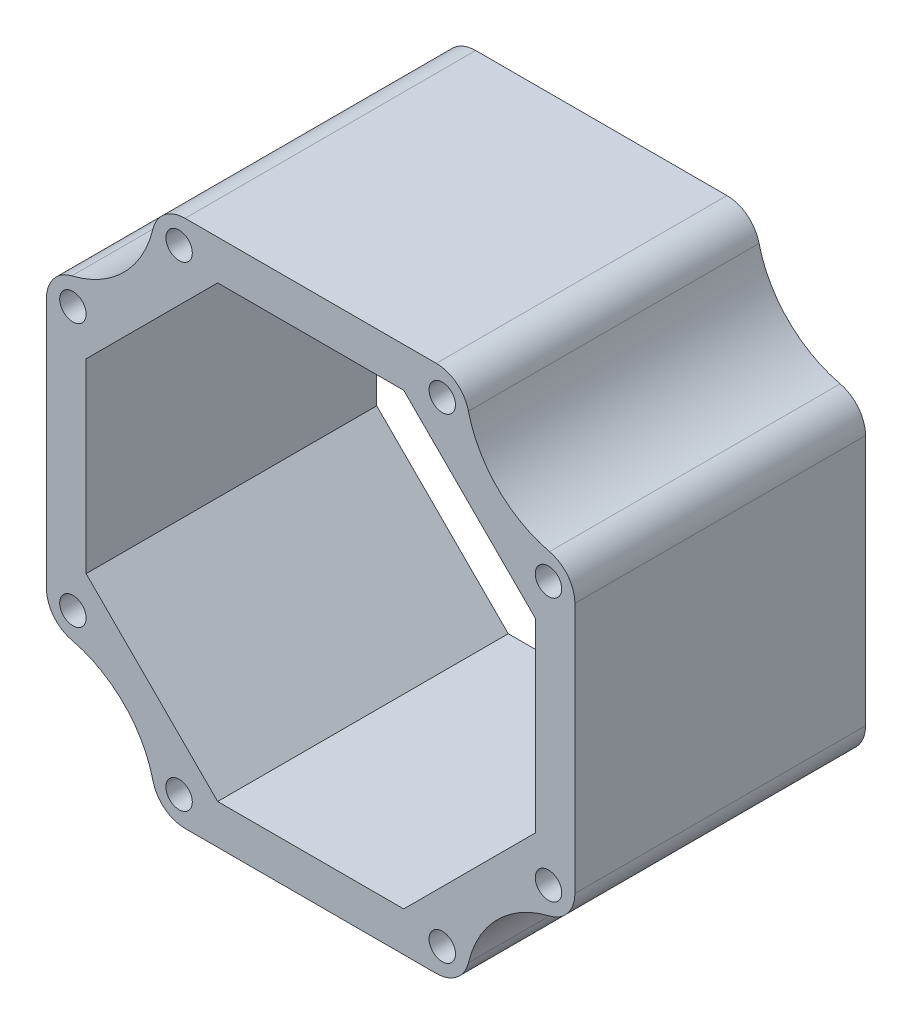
ISO-10303-21;
HEADER;
FILE_DESCRIPTION(('STEP AP214'),'2;1');
FILE_NAME('part.step','',(''),(''),'','','');
FILE_SCHEMA(('AUTOMOTIVE_DESIGN { 1 0 10303 214 1 1 1 1 }'));
ENDSEC;
DATA;
#1=APPLICATION_CONTEXT('core data for automotive mechanical design processes');
#2=APPLICATION_PROTOCOL_DEFINITION('international standard','automotive_design',2000,#1);
#3=PRODUCT_CONTEXT('',#1,'mechanical');
#4=PRODUCT('Part','Part','',(#3));
#5=PRODUCT_RELATED_PRODUCT_CATEGORY('part','',(#4));
#6=PRODUCT_DEFINITION_FORMATION('','',#4);
#7=PRODUCT_DEFINITION_CONTEXT('part definition',#1,'design');
#8=PRODUCT_DEFINITION('design','',#6,#7);
#9=PRODUCT_DEFINITION_SHAPE('','',#8);
#10=(LENGTH_UNIT() NAMED_UNIT(*) SI_UNIT(.MILLI.,.METRE.));
#11=(NAMED_UNIT(*) PLANE_ANGLE_UNIT() SI_UNIT($,.RADIAN.));
#12=(NAMED_UNIT(*) SI_UNIT($,.STERADIAN.) SOLID_ANGLE_UNIT());
#13=UNCERTAINTY_MEASURE_WITH_UNIT(LENGTH_MEASURE(1.E-05),#10,'distance_accuracy_value','');
#14=(GEOMETRIC_REPRESENTATION_CONTEXT(3) GLOBAL_UNCERTAINTY_ASSIGNED_CONTEXT((#13)) GLOBAL_UNIT_ASSIGNED_CONTEXT((#10,
#11,#12)) REPRESENTATION_CONTEXT('',''));
#15=CARTESIAN_POINT('',(0.,0.,0.));
#16=DIRECTION('',(0.,0.,1.));
#17=DIRECTION('',(1.,0.,0.));
#18=AXIS2_PLACEMENT_3D('',#15,#16,#17);
#19=CARTESIAN_POINT('',(20.,20.,-11.));
#20=DIRECTION('',(0.,0.,1.));
#21=DIRECTION('',(1.,0.,0.));
#22=AXIS2_PLACEMENT_3D('',#19,#20,#21);
#23=CYLINDRICAL_SURFACE('',#22,8.2842712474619);
#24=CARTESIAN_POINT('',(20.,20.,11.));
#25=DIRECTION('',(0.,0.,-1.));
#26=DIRECTION('',(-1.,0.,0.));
#27=AXIS2_PLACEMENT_3D('',#24,#25,#26);
#28=CIRCLE('',#27,8.2842712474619);
#29=CARTESIAN_POINT('',(18.0795477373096,11.9414012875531,11.));
#30=VERTEX_POINT('',#29);
#31=CARTESIAN_POINT('',(11.9414012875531,18.0795477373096,11.));
#32=VERTEX_POINT('',#31);
#33=EDGE_CURVE('E241',#30,#32,#28,.T.);
#34=ORIENTED_EDGE('',*,*,#33,.F.);
#35=DIRECTION('',(0.,0.,1.));
#36=VECTOR('',#35,1.);
#37=CARTESIAN_POINT('',(18.0795477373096,11.9414012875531,-11.));
#38=LINE('',#37,#36);
#39=CARTESIAN_POINT('',(18.0795477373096,11.9414012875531,-11.));
#40=VERTEX_POINT('',#39);
#41=EDGE_CURVE('E369',#30,#40,#38,.F.);
#42=ORIENTED_EDGE('',*,*,#41,.T.);
#43=CARTESIAN_POINT('',(20.,20.,-11.));
#44=DIRECTION('',(0.,0.,-1.));
#45=DIRECTION('',(-1.,0.,0.));
#46=AXIS2_PLACEMENT_3D('',#43,#44,#45);
#47=CIRCLE('',#46,8.2842712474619);
#48=CARTESIAN_POINT('',(11.9414012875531,18.0795477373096,-11.));
#49=VERTEX_POINT('',#48);
#50=EDGE_CURVE('E286',#40,#49,#47,.T.);
#51=ORIENTED_EDGE('',*,*,#50,.T.);
#52=DIRECTION('',(0.,0.,1.));
#53=VECTOR('',#52,1.);
#54=CARTESIAN_POINT('',(11.9414012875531,18.0795477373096,-11.));
#55=LINE('',#54,#53);
#56=EDGE_CURVE('E366',#49,#32,#55,.T.);
#57=ORIENTED_EDGE('',*,*,#56,.T.);
#58=EDGE_LOOP('',(#34,#42,#51,#57));
#59=FACE_BOUND('',#58,.T.);
#60=ADVANCED_FACE('F32',(#59),#23,.F.);
#61=CARTESIAN_POINT('',(20.,11.7157287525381,-11.));
#62=DIRECTION('',(1.,0.,0.));
#63=DIRECTION('',(0.,0.,-1.));
#64=AXIS2_PLACEMENT_3D('',#61,#62,#63);
#65=PLANE('',#64);
#66=DIRECTION('',(0.,1.,0.));
#67=VECTOR('',#66,1.);
#68=CARTESIAN_POINT('',(20.,11.7157287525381,11.));
#69=LINE('',#68,#67);
#70=CARTESIAN_POINT('',(20.,-9.50950399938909,11.));
#71=VERTEX_POINT('',#70);
#72=CARTESIAN_POINT('',(20.,9.50950399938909,11.));
#73=VERTEX_POINT('',#72);
#74=EDGE_CURVE('E262',#71,#73,#69,.T.);
#75=ORIENTED_EDGE('',*,*,#74,.F.);
#76=DIRECTION('',(0.,0.,1.));
#77=VECTOR('',#76,1.);
#78=CARTESIAN_POINT('',(20.,-9.50950399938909,-11.));
#79=LINE('',#78,#77);
#80=CARTESIAN_POINT('',(20.,-9.50950399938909,-11.));
#81=VERTEX_POINT('',#80);
#82=EDGE_CURVE('E364',#71,#81,#79,.F.);
#83=ORIENTED_EDGE('',*,*,#82,.T.);
#84=DIRECTION('',(0.,1.,0.));
#85=VECTOR('',#84,1.);
#86=CARTESIAN_POINT('',(20.,11.7157287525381,-11.));
#87=LINE('',#86,#85);
#88=CARTESIAN_POINT('',(20.,9.50950399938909,-11.));
#89=VERTEX_POINT('',#88);
#90=EDGE_CURVE('E317',#81,#89,#87,.T.);
#91=ORIENTED_EDGE('',*,*,#90,.T.);
#92=DIRECTION('',(0.,0.,1.));
#93=VECTOR('',#92,1.);
#94=CARTESIAN_POINT('',(20.,9.50950399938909,-11.));
#95=LINE('',#94,#93);
#96=EDGE_CURVE('E361',#89,#73,#95,.T.);
#97=ORIENTED_EDGE('',*,*,#96,.T.);
#98=EDGE_LOOP('',(#75,#83,#91,#97));
#99=FACE_BOUND('',#98,.T.);
#100=ADVANCED_FACE('F412',(#99),#65,.T.);
#101=CARTESIAN_POINT('',(20.,-20.,-11.));
#102=DIRECTION('',(0.,0.,1.));
#103=DIRECTION('',(1.,0.,0.));
#104=AXIS2_PLACEMENT_3D('',#101,#102,#103);
#105=CYLINDRICAL_SURFACE('',#104,8.2842712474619);
#106=CARTESIAN_POINT('',(20.,-20.,11.));
#107=DIRECTION('',(0.,0.,-1.));
#108=DIRECTION('',(-1.,0.,0.));
#109=AXIS2_PLACEMENT_3D('',#106,#107,#108);
#110=CIRCLE('',#109,8.2842712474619);
#111=CARTESIAN_POINT('',(11.9414012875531,-18.0795477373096,11.));
#112=VERTEX_POINT('',#111);
#113=CARTESIAN_POINT('',(18.0795477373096,-11.9414012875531,11.));
#114=VERTEX_POINT('',#113);
#115=EDGE_CURVE('E259',#112,#114,#110,.T.);
#116=ORIENTED_EDGE('',*,*,#115,.F.);
#117=DIRECTION('',(0.,0.,1.));
#118=VECTOR('',#117,1.);
#119=CARTESIAN_POINT('',(11.9414012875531,-18.0795477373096,-11.));
#120=LINE('',#119,#118);
#121=CARTESIAN_POINT('',(11.9414012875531,-18.0795477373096,-11.));
#122=VERTEX_POINT('',#121);
#123=EDGE_CURVE('E344',#112,#122,#120,.F.);
#124=ORIENTED_EDGE('',*,*,#123,.T.);
#125=CARTESIAN_POINT('',(20.,-20.,-11.));
#126=DIRECTION('',(0.,0.,-1.));
#127=DIRECTION('',(-1.,0.,0.));
#128=AXIS2_PLACEMENT_3D('',#125,#126,#127);
#129=CIRCLE('',#128,8.2842712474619);
#130=CARTESIAN_POINT('',(18.0795477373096,-11.9414012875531,-11.));
#131=VERTEX_POINT('',#130);
#132=EDGE_CURVE('E314',#122,#131,#129,.T.);
#133=ORIENTED_EDGE('',*,*,#132,.T.);
#134=DIRECTION('',(0.,0.,1.));
#135=VECTOR('',#134,1.);
#136=CARTESIAN_POINT('',(18.0795477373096,-11.9414012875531,-11.));
#137=LINE('',#136,#135);
#138=EDGE_CURVE('E341',#131,#114,#137,.T.);
#139=ORIENTED_EDGE('',*,*,#138,.T.);
#140=EDGE_LOOP('',(#116,#124,#133,#139));
#141=FACE_BOUND('',#140,.T.);
#142=ADVANCED_FACE('F420',(#141),#105,.F.);
#143=CARTESIAN_POINT('',(-11.7157287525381,-20.,-11.));
#144=DIRECTION('',(0.,-1.,0.));
#145=DIRECTION('',(0.,0.,-1.));
#146=AXIS2_PLACEMENT_3D('',#143,#144,#145);
#147=PLANE('',#146);
#148=DIRECTION('',(1.,0.,0.));
#149=VECTOR('',#148,1.);
#150=CARTESIAN_POINT('',(-11.7157287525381,-20.,-11.));
#151=LINE('',#150,#149);
#152=CARTESIAN_POINT('',(-9.50950399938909,-20.,-11.));
#153=VERTEX_POINT('',#152);
#154=CARTESIAN_POINT('',(9.50950399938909,-20.,-11.));
#155=VERTEX_POINT('',#154);
#156=EDGE_CURVE('E311',#153,#155,#151,.T.);
#157=ORIENTED_EDGE('',*,*,#156,.T.);
#158=DIRECTION('',(0.,0.,1.));
#159=VECTOR('',#158,1.);
#160=CARTESIAN_POINT('',(9.50950399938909,-20.,-11.));
#161=LINE('',#160,#159);
#162=CARTESIAN_POINT('',(9.50950399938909,-20.,11.));
#163=VERTEX_POINT('',#162);
#164=EDGE_CURVE('E322',#155,#163,#161,.T.);
#165=ORIENTED_EDGE('',*,*,#164,.T.);
#166=DIRECTION('',(1.,0.,0.));
#167=VECTOR('',#166,1.);
#168=CARTESIAN_POINT('',(-11.7157287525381,-20.,11.));
#169=LINE('',#168,#167);
#170=CARTESIAN_POINT('',(-9.50950399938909,-20.,11.));
#171=VERTEX_POINT('',#170);
#172=EDGE_CURVE('E256',#171,#163,#169,.T.);
#173=ORIENTED_EDGE('',*,*,#172,.F.);
#174=DIRECTION('',(0.,0.,1.));
#175=VECTOR('',#174,1.);
#176=CARTESIAN_POINT('',(-9.50950399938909,-20.,-11.));
#177=LINE('',#176,#175);
#178=EDGE_CURVE('E320',#171,#153,#177,.F.);
#179=ORIENTED_EDGE('',*,*,#178,.T.);
#180=EDGE_LOOP('',(#157,#165,#173,#179));
#181=FACE_BOUND('',#180,.T.);
#182=ADVANCED_FACE('F429',(#181),#147,.T.);
#183=CARTESIAN_POINT('',(-20.,-20.,-11.));
#184=DIRECTION('',(0.,0.,1.));
#185=DIRECTION('',(1.,0.,0.));
#186=AXIS2_PLACEMENT_3D('',#183,#184,#185);
#187=CYLINDRICAL_SURFACE('',#186,8.2842712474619);
#188=CARTESIAN_POINT('',(-20.,-20.,-11.));
#189=DIRECTION('',(0.,0.,-1.));
#190=DIRECTION('',(-1.,0.,0.));
#191=AXIS2_PLACEMENT_3D('',#188,#189,#190);
#192=CIRCLE('',#191,8.2842712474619);
#193=CARTESIAN_POINT('',(-18.0795477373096,-11.9414012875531,-11.));
#194=VERTEX_POINT('',#193);
#195=CARTESIAN_POINT('',(-11.9414012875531,-18.0795477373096,-11.));
#196=VERTEX_POINT('',#195);
#197=EDGE_CURVE('E308',#194,#196,#192,.T.);
#198=ORIENTED_EDGE('',*,*,#197,.T.);
#199=DIRECTION('',(0.,0.,1.));
#200=VECTOR('',#199,1.);
#201=CARTESIAN_POINT('',(-11.9414012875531,-18.0795477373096,-11.));
#202=LINE('',#201,#200);
#203=CARTESIAN_POINT('',(-11.9414012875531,-18.0795477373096,11.));
#204=VERTEX_POINT('',#203);
#205=EDGE_CURVE('E377',#196,#204,#202,.T.);
#206=ORIENTED_EDGE('',*,*,#205,.T.);
#207=CARTESIAN_POINT('',(-20.,-20.,11.));
#208=DIRECTION('',(0.,0.,-1.));
#209=DIRECTION('',(-1.,0.,0.));
#210=AXIS2_PLACEMENT_3D('',#207,#208,#209);
#211=CIRCLE('',#210,8.2842712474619);
#212=CARTESIAN_POINT('',(-18.0795477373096,-11.9414012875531,11.));
#213=VERTEX_POINT('',#212);
#214=EDGE_CURVE('E253',#213,#204,#211,.T.);
#215=ORIENTED_EDGE('',*,*,#214,.F.);
#216=DIRECTION('',(0.,0.,1.));
#217=VECTOR('',#216,1.);
#218=CARTESIAN_POINT('',(-18.0795477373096,-11.9414012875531,-11.));
#219=LINE('',#218,#217);
#220=EDGE_CURVE('E375',#213,#194,#219,.F.);
#221=ORIENTED_EDGE('',*,*,#220,.T.);
#222=EDGE_LOOP('',(#198,#206,#215,#221));
#223=FACE_BOUND('',#222,.T.);
#224=ADVANCED_FACE('F437',(#223),#187,.F.);
#225=CARTESIAN_POINT('',(-20.,11.7157287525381,-11.));
#226=DIRECTION('',(-1.,0.,0.));
#227=DIRECTION('',(0.,0.,1.));
#228=AXIS2_PLACEMENT_3D('',#225,#226,#227);
#229=PLANE('',#228);
#230=DIRECTION('',(0.,-1.,0.));
#231=VECTOR('',#230,1.);
#232=CARTESIAN_POINT('',(-20.,11.7157287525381,-11.));
#233=LINE('',#232,#231);
#234=CARTESIAN_POINT('',(-20.,9.50950399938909,-11.));
#235=VERTEX_POINT('',#234);
#236=CARTESIAN_POINT('',(-20.,-9.50950399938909,-11.));
#237=VERTEX_POINT('',#236);
#238=EDGE_CURVE('E305',#235,#237,#233,.T.);
#239=ORIENTED_EDGE('',*,*,#238,.T.);
#240=DIRECTION('',(0.,0.,1.));
#241=VECTOR('',#240,1.);
#242=CARTESIAN_POINT('',(-20.,-9.50950399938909,-11.));
#243=LINE('',#242,#241);
#244=CARTESIAN_POINT('',(-20.,-9.50950399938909,11.));
#245=VERTEX_POINT('',#244);
#246=EDGE_CURVE('E382',#237,#245,#243,.T.);
#247=ORIENTED_EDGE('',*,*,#246,.T.);
#248=DIRECTION('',(0.,-1.,0.));
#249=VECTOR('',#248,1.);
#250=CARTESIAN_POINT('',(-20.,11.7157287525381,11.));
#251=LINE('',#250,#249);
#252=CARTESIAN_POINT('',(-20.,9.50950399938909,11.));
#253=VERTEX_POINT('',#252);
#254=EDGE_CURVE('E250',#253,#245,#251,.T.);
#255=ORIENTED_EDGE('',*,*,#254,.F.);
#256=DIRECTION('',(0.,0.,1.));
#257=VECTOR('',#256,1.);
#258=CARTESIAN_POINT('',(-20.,9.50950399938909,-11.));
#259=LINE('',#258,#257);
#260=EDGE_CURVE('E380',#253,#235,#259,.F.);
#261=ORIENTED_EDGE('',*,*,#260,.T.);
#262=EDGE_LOOP('',(#239,#247,#255,#261));
#263=FACE_BOUND('',#262,.T.);
#264=ADVANCED_FACE('F446',(#263),#229,.T.);
#265=CARTESIAN_POINT('',(-20.,20.,-11.));
#266=DIRECTION('',(0.,0.,1.));
#267=DIRECTION('',(1.,0.,0.));
#268=AXIS2_PLACEMENT_3D('',#265,#266,#267);
#269=CYLINDRICAL_SURFACE('',#268,8.2842712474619);
#270=CARTESIAN_POINT('',(-20.,20.,-11.));
#271=DIRECTION('',(0.,0.,-1.));
#272=DIRECTION('',(-1.,0.,0.));
#273=AXIS2_PLACEMENT_3D('',#270,#271,#272);
#274=CIRCLE('',#273,8.2842712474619);
#275=CARTESIAN_POINT('',(-11.9414012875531,18.0795477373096,-11.));
#276=VERTEX_POINT('',#275);
#277=CARTESIAN_POINT('',(-18.0795477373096,11.9414012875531,-11.));
#278=VERTEX_POINT('',#277);
#279=EDGE_CURVE('E302',#276,#278,#274,.T.);
#280=ORIENTED_EDGE('',*,*,#279,.T.);
#281=DIRECTION('',(0.,0.,1.));
#282=VECTOR('',#281,1.);
#283=CARTESIAN_POINT('',(-18.0795477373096,11.9414012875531,-11.));
#284=LINE('',#283,#282);
#285=CARTESIAN_POINT('',(-18.0795477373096,11.9414012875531,11.));
#286=VERTEX_POINT('',#285);
#287=EDGE_CURVE('E11',#278,#286,#284,.T.);
#288=ORIENTED_EDGE('',*,*,#287,.T.);
#289=CARTESIAN_POINT('',(-20.,20.,11.));
#290=DIRECTION('',(0.,0.,-1.));
#291=DIRECTION('',(-1.,0.,0.));
#292=AXIS2_PLACEMENT_3D('',#289,#290,#291);
#293=CIRCLE('',#292,8.2842712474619);
#294=CARTESIAN_POINT('',(-11.9414012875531,18.0795477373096,11.));
#295=VERTEX_POINT('',#294);
#296=EDGE_CURVE('E247',#295,#286,#293,.T.);
#297=ORIENTED_EDGE('',*,*,#296,.F.);
#298=DIRECTION('',(0.,0.,1.));
#299=VECTOR('',#298,1.);
#300=CARTESIAN_POINT('',(-11.9414012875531,18.0795477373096,-11.));
#301=LINE('',#300,#299);
#302=EDGE_CURVE('E40',#295,#276,#301,.F.);
#303=ORIENTED_EDGE('',*,*,#302,.T.);
#304=EDGE_LOOP('',(#280,#288,#297,#303));
#305=FACE_BOUND('',#304,.T.);
#306=ADVANCED_FACE('F387',(#305),#269,.F.);
#307=CARTESIAN_POINT('',(-11.7157287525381,20.,-11.));
#308=DIRECTION('',(0.,1.,0.));
#309=DIRECTION('',(0.,0.,1.));
#310=AXIS2_PLACEMENT_3D('',#307,#308,#309);
#311=PLANE('',#310);
#312=DIRECTION('',(-1.,0.,0.));
#313=VECTOR('',#312,1.);
#314=CARTESIAN_POINT('',(-11.7157287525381,20.,11.));
#315=LINE('',#314,#313);
#316=CARTESIAN_POINT('',(9.50950399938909,20.,11.));
#317=VERTEX_POINT('',#316);
#318=CARTESIAN_POINT('',(-9.50950399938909,20.,11.));
#319=VERTEX_POINT('',#318);
#320=EDGE_CURVE('E244',#317,#319,#315,.T.);
#321=ORIENTED_EDGE('',*,*,#320,.F.);
#322=DIRECTION('',(0.,0.,1.));
#323=VECTOR('',#322,1.);
#324=CARTESIAN_POINT('',(9.50950399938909,20.,-11.));
#325=LINE('',#324,#323);
#326=CARTESIAN_POINT('',(9.50950399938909,20.,-11.));
#327=VERTEX_POINT('',#326);
#328=EDGE_CURVE('E54',#317,#327,#325,.F.);
#329=ORIENTED_EDGE('',*,*,#328,.T.);
#330=DIRECTION('',(-1.,0.,0.));
#331=VECTOR('',#330,1.);
#332=CARTESIAN_POINT('',(-11.7157287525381,20.,-11.));
#333=LINE('',#332,#331);
#334=CARTESIAN_POINT('',(-9.50950399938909,20.,-11.));
#335=VERTEX_POINT('',#334);
#336=EDGE_CURVE('E300',#327,#335,#333,.T.);
#337=ORIENTED_EDGE('',*,*,#336,.T.);
#338=DIRECTION('',(0.,0.,1.));
#339=VECTOR('',#338,1.);
#340=CARTESIAN_POINT('',(-9.50950399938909,20.,-11.));
#341=LINE('',#340,#339);
#342=EDGE_CURVE('E371',#335,#319,#341,.T.);
#343=ORIENTED_EDGE('',*,*,#342,.T.);
#344=EDGE_LOOP('',(#321,#329,#337,#343));
#345=FACE_BOUND('',#344,.T.);
#346=ADVANCED_FACE('F395',(#345),#311,.T.);
#347=CARTESIAN_POINT('',(20.,20.,-11.));
#348=DIRECTION('',(0.,0.,-1.));
#349=DIRECTION('',(-1.,0.,0.));
#350=AXIS2_PLACEMENT_3D('',#347,#348,#349);
#351=PLANE('',#350);
#352=CARTESIAN_POINT('',(-18.,-9.96077428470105,-11.));
#353=DIRECTION('',(0.,0.,-1.));
#354=DIRECTION('',(-1.,0.,0.));
#355=AXIS2_PLACEMENT_3D('',#352,#353,#354);
#356=CIRCLE('',#355,1.);
#357=CARTESIAN_POINT('',(-19.,-9.96077428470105,-11.));
#358=VERTEX_POINT('',#357);
#359=EDGE_CURVE('E765',#358,#358,#356,.F.);
#360=ORIENTED_EDGE('',*,*,#359,.T.);
#361=EDGE_LOOP('',(#360));
#362=FACE_BOUND('',#361,.T.);
#363=CARTESIAN_POINT('',(-9.96077428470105,-18.,-11.));
#364=DIRECTION('',(0.,0.,-1.));
#365=DIRECTION('',(-1.,0.,0.));
#366=AXIS2_PLACEMENT_3D('',#363,#364,#365);
#367=CIRCLE('',#366,1.);
#368=CARTESIAN_POINT('',(-10.9607742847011,-18.,-11.));
#369=VERTEX_POINT('',#368);
#370=EDGE_CURVE('E769',#369,#369,#367,.F.);
#371=ORIENTED_EDGE('',*,*,#370,.T.);
#372=EDGE_LOOP('',(#371));
#373=FACE_BOUND('',#372,.T.);
#374=CARTESIAN_POINT('',(9.96077428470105,-18.,-11.));
#375=DIRECTION('',(0.,0.,-1.));
#376=DIRECTION('',(-1.,0.,0.));
#377=AXIS2_PLACEMENT_3D('',#374,#375,#376);
#378=CIRCLE('',#377,1.);
#379=CARTESIAN_POINT('',(8.96077428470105,-18.,-11.));
#380=VERTEX_POINT('',#379);
#381=EDGE_CURVE('E778',#380,#380,#378,.F.);
#382=ORIENTED_EDGE('',*,*,#381,.T.);
#383=EDGE_LOOP('',(#382));
#384=FACE_BOUND('',#383,.T.);
#385=CARTESIAN_POINT('',(18.,-9.96077428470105,-11.));
#386=DIRECTION('',(0.,0.,-1.));
#387=DIRECTION('',(-1.,0.,0.));
#388=AXIS2_PLACEMENT_3D('',#385,#386,#387);
#389=CIRCLE('',#388,1.);
#390=CARTESIAN_POINT('',(17.,-9.96077428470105,-11.));
#391=VERTEX_POINT('',#390);
#392=EDGE_CURVE('E784',#391,#391,#389,.F.);
#393=ORIENTED_EDGE('',*,*,#392,.T.);
#394=EDGE_LOOP('',(#393));
#395=FACE_BOUND('',#394,.T.);
#396=CARTESIAN_POINT('',(18.,9.96077428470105,-11.));
#397=DIRECTION('',(0.,0.,-1.));
#398=DIRECTION('',(-1.,0.,0.));
#399=AXIS2_PLACEMENT_3D('',#396,#397,#398);
#400=CIRCLE('',#399,1.);
#401=CARTESIAN_POINT('',(17.,9.96077428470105,-11.));
#402=VERTEX_POINT('',#401);
#403=EDGE_CURVE('E790',#402,#402,#400,.F.);
#404=ORIENTED_EDGE('',*,*,#403,.T.);
#405=EDGE_LOOP('',(#404));
#406=FACE_BOUND('',#405,.T.);
#407=CARTESIAN_POINT('',(9.96077428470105,18.,-11.));
#408=DIRECTION('',(0.,0.,-1.));
#409=DIRECTION('',(-1.,0.,0.));
#410=AXIS2_PLACEMENT_3D('',#407,#408,#409);
#411=CIRCLE('',#410,1.);
#412=CARTESIAN_POINT('',(8.96077428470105,18.,-11.));
#413=VERTEX_POINT('',#412);
#414=EDGE_CURVE('E796',#413,#413,#411,.F.);
#415=ORIENTED_EDGE('',*,*,#414,.T.);
#416=EDGE_LOOP('',(#415));
#417=FACE_BOUND('',#416,.T.);
#418=CARTESIAN_POINT('',(-9.96077428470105,18.,-11.));
#419=DIRECTION('',(0.,0.,-1.));
#420=DIRECTION('',(-1.,0.,0.));
#421=AXIS2_PLACEMENT_3D('',#418,#419,#420);
#422=CIRCLE('',#421,1.);
#423=CARTESIAN_POINT('',(-10.9607742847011,18.,-11.));
#424=VERTEX_POINT('',#423);
#425=EDGE_CURVE('E802',#424,#424,#422,.F.);
#426=ORIENTED_EDGE('',*,*,#425,.T.);
#427=EDGE_LOOP('',(#426));
#428=FACE_BOUND('',#427,.T.);
#429=CARTESIAN_POINT('',(-18.,9.96077428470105,-11.));
#430=DIRECTION('',(0.,0.,-1.));
#431=DIRECTION('',(-1.,0.,0.));
#432=AXIS2_PLACEMENT_3D('',#429,#430,#431);
#433=CIRCLE('',#432,1.);
#434=CARTESIAN_POINT('',(-19.,9.96077428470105,-11.));
#435=VERTEX_POINT('',#434);
#436=EDGE_CURVE('E217',#435,#435,#433,.F.);
#437=ORIENTED_EDGE('',*,*,#436,.T.);
#438=EDGE_LOOP('',(#437));
#439=FACE_BOUND('',#438,.T.);
#440=DIRECTION('',(-0.707106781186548,-0.707106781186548,0.));
#441=VECTOR('',#440,1.);
#442=CARTESIAN_POINT('',(-17.,7.04163056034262,-11.));
#443=LINE('',#442,#441);
#444=CARTESIAN_POINT('',(-7.04163056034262,17.,-11.));
#445=VERTEX_POINT('',#444);
#446=CARTESIAN_POINT('',(-17.,7.04163056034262,-11.));
#447=VERTEX_POINT('',#446);
#448=EDGE_CURVE('E265',#445,#447,#443,.T.);
#449=ORIENTED_EDGE('',*,*,#448,.T.);
#450=DIRECTION('',(0.,-1.,0.));
#451=VECTOR('',#450,1.);
#452=CARTESIAN_POINT('',(-17.,-7.04163056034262,-11.));
#453=LINE('',#452,#451);
#454=CARTESIAN_POINT('',(-17.,-7.04163056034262,-11.));
#455=VERTEX_POINT('',#454);
#456=EDGE_CURVE('E203',#447,#455,#453,.T.);
#457=ORIENTED_EDGE('',*,*,#456,.T.);
#458=DIRECTION('',(0.707106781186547,-0.707106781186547,0.));
#459=VECTOR('',#458,1.);
#460=CARTESIAN_POINT('',(-7.04163056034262,-17.,-11.));
#461=LINE('',#460,#459);
#462=CARTESIAN_POINT('',(-7.04163056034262,-17.,-11.));
#463=VERTEX_POINT('',#462);
#464=EDGE_CURVE('E268',#455,#463,#461,.T.);
#465=ORIENTED_EDGE('',*,*,#464,.T.);
#466=DIRECTION('',(1.,0.,0.));
#467=VECTOR('',#466,1.);
#468=CARTESIAN_POINT('',(7.04163056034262,-17.,-11.));
#469=LINE('',#468,#467);
#470=CARTESIAN_POINT('',(7.04163056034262,-17.,-11.));
#471=VERTEX_POINT('',#470);
#472=EDGE_CURVE('E271',#463,#471,#469,.T.);
#473=ORIENTED_EDGE('',*,*,#472,.T.);
#474=DIRECTION('',(0.707106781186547,0.707106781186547,0.));
#475=VECTOR('',#474,1.);
#476=CARTESIAN_POINT('',(17.,-7.04163056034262,-11.));
#477=LINE('',#476,#475);
#478=CARTESIAN_POINT('',(17.,-7.04163056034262,-11.));
#479=VERTEX_POINT('',#478);
#480=EDGE_CURVE('E274',#471,#479,#477,.T.);
#481=ORIENTED_EDGE('',*,*,#480,.T.);
#482=DIRECTION('',(0.,1.,0.));
#483=VECTOR('',#482,1.);
#484=CARTESIAN_POINT('',(17.,-7.04163056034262,-11.));
#485=LINE('',#484,#483);
#486=CARTESIAN_POINT('',(17.,7.04163056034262,-11.));
#487=VERTEX_POINT('',#486);
#488=EDGE_CURVE('E277',#479,#487,#485,.T.);
#489=ORIENTED_EDGE('',*,*,#488,.T.);
#490=DIRECTION('',(-0.707106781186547,0.707106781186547,0.));
#491=VECTOR('',#490,1.);
#492=CARTESIAN_POINT('',(7.04163056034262,17.,-11.));
#493=LINE('',#492,#491);
#494=CARTESIAN_POINT('',(7.04163056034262,17.,-11.));
#495=VERTEX_POINT('',#494);
#496=EDGE_CURVE('E280',#487,#495,#493,.T.);
#497=ORIENTED_EDGE('',*,*,#496,.T.);
#498=DIRECTION('',(-1.,0.,0.));
#499=VECTOR('',#498,1.);
#500=CARTESIAN_POINT('',(-7.04163056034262,17.,-11.));
#501=LINE('',#500,#499);
#502=EDGE_CURVE('E208',#495,#445,#501,.T.);
#503=ORIENTED_EDGE('',*,*,#502,.T.);
#504=EDGE_LOOP('',(#449,#457,#465,#473,#481,#489,#497,#503));
#505=FACE_BOUND('',#504,.T.);
#506=ORIENTED_EDGE('',*,*,#132,.F.);
#507=CARTESIAN_POINT('',(9.50950399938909,-17.5,-11.));
#508=DIRECTION('',(0.,0.,-1.));
#509=DIRECTION('',(-1.,0.,0.));
#510=AXIS2_PLACEMENT_3D('',#507,#508,#509);
#511=CIRCLE('',#510,2.5);
#512=EDGE_CURVE('E359',#122,#155,#511,.T.);
#513=ORIENTED_EDGE('',*,*,#512,.T.);
#514=ORIENTED_EDGE('',*,*,#156,.F.);
#515=CARTESIAN_POINT('',(-9.50950399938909,-17.5,-11.));
#516=DIRECTION('',(0.,0.,-1.));
#517=DIRECTION('',(-1.,0.,0.));
#518=AXIS2_PLACEMENT_3D('',#515,#516,#517);
#519=CIRCLE('',#518,2.5);
#520=EDGE_CURVE('E351',#153,#196,#519,.T.);
#521=ORIENTED_EDGE('',*,*,#520,.T.);
#522=ORIENTED_EDGE('',*,*,#197,.F.);
#523=CARTESIAN_POINT('',(-17.5,-9.50950399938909,-11.));
#524=DIRECTION('',(0.,0.,-1.));
#525=DIRECTION('',(-1.,0.,0.));
#526=AXIS2_PLACEMENT_3D('',#523,#524,#525);
#527=CIRCLE('',#526,2.5);
#528=EDGE_CURVE('E349',#194,#237,#527,.T.);
#529=ORIENTED_EDGE('',*,*,#528,.T.);
#530=ORIENTED_EDGE('',*,*,#238,.F.);
#531=CARTESIAN_POINT('',(-17.5,9.50950399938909,-11.));
#532=DIRECTION('',(0.,0.,-1.));
#533=DIRECTION('',(-1.,0.,0.));
#534=AXIS2_PLACEMENT_3D('',#531,#532,#533);
#535=CIRCLE('',#534,2.5);
#536=EDGE_CURVE('E347',#235,#278,#535,.T.);
#537=ORIENTED_EDGE('',*,*,#536,.T.);
#538=ORIENTED_EDGE('',*,*,#279,.F.);
#539=CARTESIAN_POINT('',(-9.50950399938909,17.5,-11.));
#540=DIRECTION('',(0.,0.,-1.));
#541=DIRECTION('',(-1.,0.,0.));
#542=AXIS2_PLACEMENT_3D('',#539,#540,#541);
#543=CIRCLE('',#542,2.5);
#544=EDGE_CURVE('E47',#276,#335,#543,.T.);
#545=ORIENTED_EDGE('',*,*,#544,.T.);
#546=ORIENTED_EDGE('',*,*,#336,.F.);
#547=CARTESIAN_POINT('',(9.50950399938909,17.5,-11.));
#548=DIRECTION('',(0.,0.,-1.));
#549=DIRECTION('',(-1.,0.,0.));
#550=AXIS2_PLACEMENT_3D('',#547,#548,#549);
#551=CIRCLE('',#550,2.5);
#552=EDGE_CURVE('E353',#327,#49,#551,.T.);
#553=ORIENTED_EDGE('',*,*,#552,.T.);
#554=ORIENTED_EDGE('',*,*,#50,.F.);
#555=CARTESIAN_POINT('',(17.5,9.50950399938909,-11.));
#556=DIRECTION('',(0.,0.,-1.));
#557=DIRECTION('',(-1.,0.,0.));
#558=AXIS2_PLACEMENT_3D('',#555,#556,#557);
#559=CIRCLE('',#558,2.5);
#560=EDGE_CURVE('E355',#40,#89,#559,.T.);
#561=ORIENTED_EDGE('',*,*,#560,.T.);
#562=ORIENTED_EDGE('',*,*,#90,.F.);
#563=CARTESIAN_POINT('',(17.5,-9.50950399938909,-11.));
#564=DIRECTION('',(0.,0.,-1.));
#565=DIRECTION('',(-1.,0.,0.));
#566=AXIS2_PLACEMENT_3D('',#563,#564,#565);
#567=CIRCLE('',#566,2.5);
#568=EDGE_CURVE('E357',#81,#131,#567,.T.);
#569=ORIENTED_EDGE('',*,*,#568,.T.);
#570=EDGE_LOOP('',(#506,#513,#514,#521,#522,#529,#530,#537,#538,#545,#546,#553,#554,#561,#562,#569));
#571=FACE_BOUND('',#570,.T.);
#572=ADVANCED_FACE('F391',(#362,#373,#384,#395,#406,#417,#428,#439,#505,#571),#351,.T.);
#573=CARTESIAN_POINT('',(-17.,7.04163056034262,-11.));
#574=DIRECTION('',(-0.707106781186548,0.707106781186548,0.));
#575=DIRECTION('',(-0.707106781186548,-0.707106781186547,0.));
#576=AXIS2_PLACEMENT_3D('',#573,#574,#575);
#577=PLANE('',#576);
#578=DIRECTION('',(0.,0.,1.));
#579=VECTOR('',#578,1.);
#580=CARTESIAN_POINT('',(-7.04163056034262,17.,-11.));
#581=LINE('',#580,#579);
#582=CARTESIAN_POINT('',(-7.04163056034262,17.,11.));
#583=VERTEX_POINT('',#582);
#584=EDGE_CURVE('E213',#445,#583,#581,.T.);
#585=ORIENTED_EDGE('',*,*,#584,.T.);
#586=DIRECTION('',(-0.707106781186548,-0.707106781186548,0.));
#587=VECTOR('',#586,1.);
#588=CARTESIAN_POINT('',(-17.,7.04163056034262,11.));
#589=LINE('',#588,#587);
#590=CARTESIAN_POINT('',(-17.,7.04163056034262,11.));
#591=VERTEX_POINT('',#590);
#592=EDGE_CURVE('E211',#583,#591,#589,.T.);
#593=ORIENTED_EDGE('',*,*,#592,.T.);
#594=DIRECTION('',(0.,0.,1.));
#595=VECTOR('',#594,1.);
#596=CARTESIAN_POINT('',(-17.,7.04163056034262,-11.));
#597=LINE('',#596,#595);
#598=EDGE_CURVE('E195',#447,#591,#597,.T.);
#599=ORIENTED_EDGE('',*,*,#598,.F.);
#600=ORIENTED_EDGE('',*,*,#448,.F.);
#601=EDGE_LOOP('',(#585,#593,#599,#600));
#602=FACE_BOUND('',#601,.T.);
#603=ADVANCED_FACE('F212',(#602),#577,.F.);
#604=CARTESIAN_POINT('',(-7.04163056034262,17.,-11.));
#605=DIRECTION('',(0.,1.,0.));
#606=DIRECTION('',(0.,0.,1.));
#607=AXIS2_PLACEMENT_3D('',#604,#605,#606);
#608=PLANE('',#607);
#609=DIRECTION('',(0.,0.,1.));
#610=VECTOR('',#609,1.);
#611=CARTESIAN_POINT('',(7.04163056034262,17.,-11.));
#612=LINE('',#611,#610);
#613=CARTESIAN_POINT('',(7.04163056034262,17.,11.));
#614=VERTEX_POINT('',#613);
#615=EDGE_CURVE('E287',#495,#614,#612,.T.);
#616=ORIENTED_EDGE('',*,*,#615,.T.);
#617=DIRECTION('',(-1.,0.,0.));
#618=VECTOR('',#617,1.);
#619=CARTESIAN_POINT('',(-7.04163056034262,17.,11.));
#620=LINE('',#619,#618);
#621=EDGE_CURVE('E239',#614,#583,#620,.T.);
#622=ORIENTED_EDGE('',*,*,#621,.T.);
#623=ORIENTED_EDGE('',*,*,#584,.F.);
#624=ORIENTED_EDGE('',*,*,#502,.F.);
#625=EDGE_LOOP('',(#616,#622,#623,#624));
#626=FACE_BOUND('',#625,.T.);
#627=ADVANCED_FACE('F604',(#626),#608,.F.);
#628=CARTESIAN_POINT('',(7.04163056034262,17.,-11.));
#629=DIRECTION('',(0.707106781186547,0.707106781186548,0.));
#630=DIRECTION('',(-0.707106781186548,0.707106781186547,0.));
#631=AXIS2_PLACEMENT_3D('',#628,#629,#630);
#632=PLANE('',#631);
#633=DIRECTION('',(0.,0.,1.));
#634=VECTOR('',#633,1.);
#635=CARTESIAN_POINT('',(17.,7.04163056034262,-11.));
#636=LINE('',#635,#634);
#637=CARTESIAN_POINT('',(17.,7.04163056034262,11.));
#638=VERTEX_POINT('',#637);
#639=EDGE_CURVE('E289',#487,#638,#636,.T.);
#640=ORIENTED_EDGE('',*,*,#639,.T.);
#641=DIRECTION('',(-0.707106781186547,0.707106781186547,0.));
#642=VECTOR('',#641,1.);
#643=CARTESIAN_POINT('',(7.04163056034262,17.,11.));
#644=LINE('',#643,#642);
#645=EDGE_CURVE('E236',#638,#614,#644,.T.);
#646=ORIENTED_EDGE('',*,*,#645,.T.);
#647=ORIENTED_EDGE('',*,*,#615,.F.);
#648=ORIENTED_EDGE('',*,*,#496,.F.);
#649=EDGE_LOOP('',(#640,#646,#647,#648));
#650=FACE_BOUND('',#649,.T.);
#651=ADVANCED_FACE('F607',(#650),#632,.F.);
#652=CARTESIAN_POINT('',(17.,-7.04163056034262,-11.));
#653=DIRECTION('',(1.,0.,0.));
#654=DIRECTION('',(0.,0.,-1.));
#655=AXIS2_PLACEMENT_3D('',#652,#653,#654);
#656=PLANE('',#655);
#657=DIRECTION('',(0.,0.,1.));
#658=VECTOR('',#657,1.);
#659=CARTESIAN_POINT('',(17.,-7.04163056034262,-11.));
#660=LINE('',#659,#658);
#661=CARTESIAN_POINT('',(17.,-7.04163056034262,11.));
#662=VERTEX_POINT('',#661);
#663=EDGE_CURVE('E291',#479,#662,#660,.T.);
#664=ORIENTED_EDGE('',*,*,#663,.T.);
#665=DIRECTION('',(0.,1.,0.));
#666=VECTOR('',#665,1.);
#667=CARTESIAN_POINT('',(17.,-7.04163056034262,11.));
#668=LINE('',#667,#666);
#669=EDGE_CURVE('E233',#662,#638,#668,.T.);
#670=ORIENTED_EDGE('',*,*,#669,.T.);
#671=ORIENTED_EDGE('',*,*,#639,.F.);
#672=ORIENTED_EDGE('',*,*,#488,.F.);
#673=EDGE_LOOP('',(#664,#670,#671,#672));
#674=FACE_BOUND('',#673,.T.);
#675=ADVANCED_FACE('F611',(#674),#656,.F.);
#676=CARTESIAN_POINT('',(17.,-7.04163056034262,-11.));
#677=DIRECTION('',(0.707106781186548,-0.707106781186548,0.));
#678=DIRECTION('',(0.707106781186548,0.707106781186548,0.));
#679=AXIS2_PLACEMENT_3D('',#676,#677,#678);
#680=PLANE('',#679);
#681=DIRECTION('',(0.,0.,1.));
#682=VECTOR('',#681,1.);
#683=CARTESIAN_POINT('',(7.04163056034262,-17.,-11.));
#684=LINE('',#683,#682);
#685=CARTESIAN_POINT('',(7.04163056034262,-17.,11.));
#686=VERTEX_POINT('',#685);
#687=EDGE_CURVE('E293',#471,#686,#684,.T.);
#688=ORIENTED_EDGE('',*,*,#687,.T.);
#689=DIRECTION('',(0.707106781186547,0.707106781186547,0.));
#690=VECTOR('',#689,1.);
#691=CARTESIAN_POINT('',(17.,-7.04163056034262,11.));
#692=LINE('',#691,#690);
#693=EDGE_CURVE('E230',#686,#662,#692,.T.);
#694=ORIENTED_EDGE('',*,*,#693,.T.);
#695=ORIENTED_EDGE('',*,*,#663,.F.);
#696=ORIENTED_EDGE('',*,*,#480,.F.);
#697=EDGE_LOOP('',(#688,#694,#695,#696));
#698=FACE_BOUND('',#697,.T.);
#699=ADVANCED_FACE('F615',(#698),#680,.F.);
#700=CARTESIAN_POINT('',(7.04163056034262,-17.,-11.));
#701=DIRECTION('',(0.,-1.,0.));
#702=DIRECTION('',(0.,0.,-1.));
#703=AXIS2_PLACEMENT_3D('',#700,#701,#702);
#704=PLANE('',#703);
#705=DIRECTION('',(0.,0.,1.));
#706=VECTOR('',#705,1.);
#707=CARTESIAN_POINT('',(-7.04163056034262,-17.,-11.));
#708=LINE('',#707,#706);
#709=CARTESIAN_POINT('',(-7.04163056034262,-17.,11.));
#710=VERTEX_POINT('',#709);
#711=EDGE_CURVE('E295',#463,#710,#708,.T.);
#712=ORIENTED_EDGE('',*,*,#711,.T.);
#713=DIRECTION('',(1.,0.,0.));
#714=VECTOR('',#713,1.);
#715=CARTESIAN_POINT('',(7.04163056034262,-17.,11.));
#716=LINE('',#715,#714);
#717=EDGE_CURVE('E224',#710,#686,#716,.T.);
#718=ORIENTED_EDGE('',*,*,#717,.T.);
#719=ORIENTED_EDGE('',*,*,#687,.F.);
#720=ORIENTED_EDGE('',*,*,#472,.F.);
#721=EDGE_LOOP('',(#712,#718,#719,#720));
#722=FACE_BOUND('',#721,.T.);
#723=ADVANCED_FACE('F619',(#722),#704,.F.);
#724=CARTESIAN_POINT('',(-7.04163056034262,-17.,-11.));
#725=DIRECTION('',(-0.707106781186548,-0.707106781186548,0.));
#726=DIRECTION('',(0.707106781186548,-0.707106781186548,0.));
#727=AXIS2_PLACEMENT_3D('',#724,#725,#726);
#728=PLANE('',#727);
#729=DIRECTION('',(0.,0.,1.));
#730=VECTOR('',#729,1.);
#731=CARTESIAN_POINT('',(-17.,-7.04163056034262,-11.));
#732=LINE('',#731,#730);
#733=CARTESIAN_POINT('',(-17.,-7.04163056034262,11.));
#734=VERTEX_POINT('',#733);
#735=EDGE_CURVE('E207',#455,#734,#732,.T.);
#736=ORIENTED_EDGE('',*,*,#735,.T.);
#737=DIRECTION('',(0.707106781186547,-0.707106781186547,0.));
#738=VECTOR('',#737,1.);
#739=CARTESIAN_POINT('',(-7.04163056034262,-17.,11.));
#740=LINE('',#739,#738);
#741=EDGE_CURVE('E222',#734,#710,#740,.T.);
#742=ORIENTED_EDGE('',*,*,#741,.T.);
#743=ORIENTED_EDGE('',*,*,#711,.F.);
#744=ORIENTED_EDGE('',*,*,#464,.F.);
#745=EDGE_LOOP('',(#736,#742,#743,#744));
#746=FACE_BOUND('',#745,.T.);
#747=ADVANCED_FACE('F623',(#746),#728,.F.);
#748=CARTESIAN_POINT('',(-17.,-7.04163056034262,-11.));
#749=DIRECTION('',(-1.,0.,0.));
#750=DIRECTION('',(0.,0.,1.));
#751=AXIS2_PLACEMENT_3D('',#748,#749,#750);
#752=PLANE('',#751);
#753=ORIENTED_EDGE('',*,*,#598,.T.);
#754=DIRECTION('',(0.,-1.,0.));
#755=VECTOR('',#754,1.);
#756=CARTESIAN_POINT('',(-17.,-7.04163056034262,11.));
#757=LINE('',#756,#755);
#758=EDGE_CURVE('E200',#591,#734,#757,.T.);
#759=ORIENTED_EDGE('',*,*,#758,.T.);
#760=ORIENTED_EDGE('',*,*,#735,.F.);
#761=ORIENTED_EDGE('',*,*,#456,.F.);
#762=EDGE_LOOP('',(#753,#759,#760,#761));
#763=FACE_BOUND('',#762,.T.);
#764=ADVANCED_FACE('F197',(#763),#752,.F.);
#765=CARTESIAN_POINT('',(20.,20.,11.));
#766=DIRECTION('',(0.,0.,-1.));
#767=DIRECTION('',(-1.,0.,0.));
#768=AXIS2_PLACEMENT_3D('',#765,#766,#767);
#769=PLANE('',#768);
#770=CARTESIAN_POINT('',(-18.,-9.96077428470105,11.));
#771=DIRECTION('',(0.,0.,1.));
#772=DIRECTION('',(1.,0.,0.));
#773=AXIS2_PLACEMENT_3D('',#770,#771,#772);
#774=CIRCLE('',#773,1.);
#775=CARTESIAN_POINT('',(-17.,-9.96077428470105,11.));
#776=VERTEX_POINT('',#775);
#777=EDGE_CURVE('E762',#776,#776,#774,.T.);
#778=ORIENTED_EDGE('',*,*,#777,.F.);
#779=EDGE_LOOP('',(#778));
#780=FACE_BOUND('',#779,.T.);
#781=CARTESIAN_POINT('',(-9.96077428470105,-18.,11.));
#782=DIRECTION('',(0.,0.,1.));
#783=DIRECTION('',(1.,0.,0.));
#784=AXIS2_PLACEMENT_3D('',#781,#782,#783);
#785=CIRCLE('',#784,1.);
#786=CARTESIAN_POINT('',(-8.96077428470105,-18.,11.));
#787=VERTEX_POINT('',#786);
#788=EDGE_CURVE('E766',#787,#787,#785,.T.);
#789=ORIENTED_EDGE('',*,*,#788,.F.);
#790=EDGE_LOOP('',(#789));
#791=FACE_BOUND('',#790,.T.);
#792=CARTESIAN_POINT('',(9.96077428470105,-18.,11.));
#793=DIRECTION('',(0.,0.,1.));
#794=DIRECTION('',(1.,0.,0.));
#795=AXIS2_PLACEMENT_3D('',#792,#793,#794);
#796=CIRCLE('',#795,1.);
#797=CARTESIAN_POINT('',(10.9607742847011,-18.,11.));
#798=VERTEX_POINT('',#797);
#799=EDGE_CURVE('E775',#798,#798,#796,.T.);
#800=ORIENTED_EDGE('',*,*,#799,.F.);
#801=EDGE_LOOP('',(#800));
#802=FACE_BOUND('',#801,.T.);
#803=CARTESIAN_POINT('',(18.,-9.96077428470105,11.));
#804=DIRECTION('',(0.,0.,1.));
#805=DIRECTION('',(1.,0.,0.));
#806=AXIS2_PLACEMENT_3D('',#803,#804,#805);
#807=CIRCLE('',#806,1.);
#808=CARTESIAN_POINT('',(19.,-9.96077428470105,11.));
#809=VERTEX_POINT('',#808);
#810=EDGE_CURVE('E781',#809,#809,#807,.T.);
#811=ORIENTED_EDGE('',*,*,#810,.F.);
#812=EDGE_LOOP('',(#811));
#813=FACE_BOUND('',#812,.T.);
#814=CARTESIAN_POINT('',(18.,9.96077428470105,11.));
#815=DIRECTION('',(0.,0.,1.));
#816=DIRECTION('',(1.,0.,0.));
#817=AXIS2_PLACEMENT_3D('',#814,#815,#816);
#818=CIRCLE('',#817,1.);
#819=CARTESIAN_POINT('',(19.,9.96077428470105,11.));
#820=VERTEX_POINT('',#819);
#821=EDGE_CURVE('E787',#820,#820,#818,.T.);
#822=ORIENTED_EDGE('',*,*,#821,.F.);
#823=EDGE_LOOP('',(#822));
#824=FACE_BOUND('',#823,.T.);
#825=CARTESIAN_POINT('',(9.96077428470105,18.,11.));
#826=DIRECTION('',(0.,0.,1.));
#827=DIRECTION('',(1.,0.,0.));
#828=AXIS2_PLACEMENT_3D('',#825,#826,#827);
#829=CIRCLE('',#828,1.);
#830=CARTESIAN_POINT('',(10.9607742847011,18.,11.));
#831=VERTEX_POINT('',#830);
#832=EDGE_CURVE('E793',#831,#831,#829,.T.);
#833=ORIENTED_EDGE('',*,*,#832,.F.);
#834=EDGE_LOOP('',(#833));
#835=FACE_BOUND('',#834,.T.);
#836=CARTESIAN_POINT('',(-9.96077428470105,18.,11.));
#837=DIRECTION('',(0.,0.,1.));
#838=DIRECTION('',(1.,0.,0.));
#839=AXIS2_PLACEMENT_3D('',#836,#837,#838);
#840=CIRCLE('',#839,1.);
#841=CARTESIAN_POINT('',(-8.96077428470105,18.,11.));
#842=VERTEX_POINT('',#841);
#843=EDGE_CURVE('E799',#842,#842,#840,.T.);
#844=ORIENTED_EDGE('',*,*,#843,.F.);
#845=EDGE_LOOP('',(#844));
#846=FACE_BOUND('',#845,.T.);
#847=CARTESIAN_POINT('',(-18.,9.96077428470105,11.));
#848=DIRECTION('',(0.,0.,1.));
#849=DIRECTION('',(1.,0.,0.));
#850=AXIS2_PLACEMENT_3D('',#847,#848,#849);
#851=CIRCLE('',#850,1.);
#852=CARTESIAN_POINT('',(-17.,9.96077428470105,11.));
#853=VERTEX_POINT('',#852);
#854=EDGE_CURVE('E805',#853,#853,#851,.T.);
#855=ORIENTED_EDGE('',*,*,#854,.F.);
#856=EDGE_LOOP('',(#855));
#857=FACE_BOUND('',#856,.T.);
#858=ORIENTED_EDGE('',*,*,#172,.T.);
#859=CARTESIAN_POINT('',(9.50950399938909,-17.5,11.));
#860=DIRECTION('',(0.,0.,-1.));
#861=DIRECTION('',(-1.,0.,0.));
#862=AXIS2_PLACEMENT_3D('',#859,#860,#861);
#863=CIRCLE('',#862,2.5);
#864=EDGE_CURVE('E339',#163,#112,#863,.F.);
#865=ORIENTED_EDGE('',*,*,#864,.T.);
#866=ORIENTED_EDGE('',*,*,#115,.T.);
#867=CARTESIAN_POINT('',(17.5,-9.50950399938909,11.));
#868=DIRECTION('',(0.,0.,-1.));
#869=DIRECTION('',(-1.,0.,0.));
#870=AXIS2_PLACEMENT_3D('',#867,#868,#869);
#871=CIRCLE('',#870,2.5);
#872=EDGE_CURVE('E337',#114,#71,#871,.F.);
#873=ORIENTED_EDGE('',*,*,#872,.T.);
#874=ORIENTED_EDGE('',*,*,#74,.T.);
#875=CARTESIAN_POINT('',(17.5,9.50950399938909,11.));
#876=DIRECTION('',(0.,0.,-1.));
#877=DIRECTION('',(-1.,0.,0.));
#878=AXIS2_PLACEMENT_3D('',#875,#876,#877);
#879=CIRCLE('',#878,2.5);
#880=EDGE_CURVE('E335',#73,#30,#879,.F.);
#881=ORIENTED_EDGE('',*,*,#880,.T.);
#882=ORIENTED_EDGE('',*,*,#33,.T.);
#883=CARTESIAN_POINT('',(9.50950399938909,17.5,11.));
#884=DIRECTION('',(0.,0.,-1.));
#885=DIRECTION('',(-1.,0.,0.));
#886=AXIS2_PLACEMENT_3D('',#883,#884,#885);
#887=CIRCLE('',#886,2.5);
#888=EDGE_CURVE('E333',#32,#317,#887,.F.);
#889=ORIENTED_EDGE('',*,*,#888,.T.);
#890=ORIENTED_EDGE('',*,*,#320,.T.);
#891=CARTESIAN_POINT('',(-9.50950399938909,17.5,11.));
#892=DIRECTION('',(0.,0.,-1.));
#893=DIRECTION('',(-1.,0.,0.));
#894=AXIS2_PLACEMENT_3D('',#891,#892,#893);
#895=CIRCLE('',#894,2.5);
#896=EDGE_CURVE('E325',#319,#295,#895,.F.);
#897=ORIENTED_EDGE('',*,*,#896,.T.);
#898=ORIENTED_EDGE('',*,*,#296,.T.);
#899=CARTESIAN_POINT('',(-17.5,9.50950399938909,11.));
#900=DIRECTION('',(0.,0.,-1.));
#901=DIRECTION('',(-1.,0.,0.));
#902=AXIS2_PLACEMENT_3D('',#899,#900,#901);
#903=CIRCLE('',#902,2.5);
#904=EDGE_CURVE('E327',#286,#253,#903,.F.);
#905=ORIENTED_EDGE('',*,*,#904,.T.);
#906=ORIENTED_EDGE('',*,*,#254,.T.);
#907=CARTESIAN_POINT('',(-17.5,-9.50950399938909,11.));
#908=DIRECTION('',(0.,0.,-1.));
#909=DIRECTION('',(-1.,0.,0.));
#910=AXIS2_PLACEMENT_3D('',#907,#908,#909);
#911=CIRCLE('',#910,2.5);
#912=EDGE_CURVE('E329',#245,#213,#911,.F.);
#913=ORIENTED_EDGE('',*,*,#912,.T.);
#914=ORIENTED_EDGE('',*,*,#214,.T.);
#915=CARTESIAN_POINT('',(-9.50950399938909,-17.5,11.));
#916=DIRECTION('',(0.,0.,-1.));
#917=DIRECTION('',(-1.,0.,0.));
#918=AXIS2_PLACEMENT_3D('',#915,#916,#917);
#919=CIRCLE('',#918,2.5);
#920=EDGE_CURVE('E331',#204,#171,#919,.F.);
#921=ORIENTED_EDGE('',*,*,#920,.T.);
#922=EDGE_LOOP('',(#858,#865,#866,#873,#874,#881,#882,#889,#890,#897,#898,#905,#906,#913,#914,#921));
#923=FACE_BOUND('',#922,.T.);
#924=ORIENTED_EDGE('',*,*,#592,.F.);
#925=ORIENTED_EDGE('',*,*,#621,.F.);
#926=ORIENTED_EDGE('',*,*,#645,.F.);
#927=ORIENTED_EDGE('',*,*,#669,.F.);
#928=ORIENTED_EDGE('',*,*,#693,.F.);
#929=ORIENTED_EDGE('',*,*,#717,.F.);
#930=ORIENTED_EDGE('',*,*,#741,.F.);
#931=ORIENTED_EDGE('',*,*,#758,.F.);
#932=EDGE_LOOP('',(#924,#925,#926,#927,#928,#929,#930,#931));
#933=FACE_BOUND('',#932,.T.);
#934=ADVANCED_FACE('F219',(#780,#791,#802,#813,#824,#835,#846,#857,#923,#933),#769,.F.);
#935=CARTESIAN_POINT('',(9.50950399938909,-17.5,-11.));
#936=DIRECTION('',(0.,0.,1.));
#937=DIRECTION('',(1.,0.,0.));
#938=AXIS2_PLACEMENT_3D('',#935,#936,#937);
#939=CYLINDRICAL_SURFACE('',#938,2.5);
#940=ORIENTED_EDGE('',*,*,#512,.F.);
#941=ORIENTED_EDGE('',*,*,#123,.F.);
#942=ORIENTED_EDGE('',*,*,#864,.F.);
#943=ORIENTED_EDGE('',*,*,#164,.F.);
#944=EDGE_LOOP('',(#940,#941,#942,#943));
#945=FACE_BOUND('',#944,.T.);
#946=ADVANCED_FACE('F426',(#945),#939,.T.);
#947=CARTESIAN_POINT('',(17.5,-9.50950399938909,-11.));
#948=DIRECTION('',(0.,0.,1.));
#949=DIRECTION('',(1.,0.,0.));
#950=AXIS2_PLACEMENT_3D('',#947,#948,#949);
#951=CYLINDRICAL_SURFACE('',#950,2.5);
#952=ORIENTED_EDGE('',*,*,#568,.F.);
#953=ORIENTED_EDGE('',*,*,#82,.F.);
#954=ORIENTED_EDGE('',*,*,#872,.F.);
#955=ORIENTED_EDGE('',*,*,#138,.F.);
#956=EDGE_LOOP('',(#952,#953,#954,#955));
#957=FACE_BOUND('',#956,.T.);
#958=ADVANCED_FACE('F418',(#957),#951,.T.);
#959=CARTESIAN_POINT('',(17.5,9.50950399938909,-11.));
#960=DIRECTION('',(0.,0.,1.));
#961=DIRECTION('',(1.,0.,0.));
#962=AXIS2_PLACEMENT_3D('',#959,#960,#961);
#963=CYLINDRICAL_SURFACE('',#962,2.5);
#964=ORIENTED_EDGE('',*,*,#560,.F.);
#965=ORIENTED_EDGE('',*,*,#41,.F.);
#966=ORIENTED_EDGE('',*,*,#880,.F.);
#967=ORIENTED_EDGE('',*,*,#96,.F.);
#968=EDGE_LOOP('',(#964,#965,#966,#967));
#969=FACE_BOUND('',#968,.T.);
#970=ADVANCED_FACE('F409',(#969),#963,.T.);
#971=CARTESIAN_POINT('',(9.50950399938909,17.5,-11.));
#972=DIRECTION('',(0.,0.,1.));
#973=DIRECTION('',(1.,0.,0.));
#974=AXIS2_PLACEMENT_3D('',#971,#972,#973);
#975=CYLINDRICAL_SURFACE('',#974,2.5);
#976=ORIENTED_EDGE('',*,*,#552,.F.);
#977=ORIENTED_EDGE('',*,*,#328,.F.);
#978=ORIENTED_EDGE('',*,*,#888,.F.);
#979=ORIENTED_EDGE('',*,*,#56,.F.);
#980=EDGE_LOOP('',(#976,#977,#978,#979));
#981=FACE_BOUND('',#980,.T.);
#982=ADVANCED_FACE('F401',(#981),#975,.T.);
#983=CARTESIAN_POINT('',(-9.50950399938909,-17.5,-11.));
#984=DIRECTION('',(0.,0.,1.));
#985=DIRECTION('',(1.,0.,0.));
#986=AXIS2_PLACEMENT_3D('',#983,#984,#985);
#987=CYLINDRICAL_SURFACE('',#986,2.5);
#988=ORIENTED_EDGE('',*,*,#520,.F.);
#989=ORIENTED_EDGE('',*,*,#178,.F.);
#990=ORIENTED_EDGE('',*,*,#920,.F.);
#991=ORIENTED_EDGE('',*,*,#205,.F.);
#992=EDGE_LOOP('',(#988,#989,#990,#991));
#993=FACE_BOUND('',#992,.T.);
#994=ADVANCED_FACE('F435',(#993),#987,.T.);
#995=CARTESIAN_POINT('',(-17.5,-9.50950399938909,-11.));
#996=DIRECTION('',(0.,0.,1.));
#997=DIRECTION('',(1.,0.,0.));
#998=AXIS2_PLACEMENT_3D('',#995,#996,#997);
#999=CYLINDRICAL_SURFACE('',#998,2.5);
#1000=ORIENTED_EDGE('',*,*,#528,.F.);
#1001=ORIENTED_EDGE('',*,*,#220,.F.);
#1002=ORIENTED_EDGE('',*,*,#912,.F.);
#1003=ORIENTED_EDGE('',*,*,#246,.F.);
#1004=EDGE_LOOP('',(#1000,#1001,#1002,#1003));
#1005=FACE_BOUND('',#1004,.T.);
#1006=ADVANCED_FACE('F443',(#1005),#999,.T.);
#1007=CARTESIAN_POINT('',(-17.5,9.50950399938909,-11.));
#1008=DIRECTION('',(0.,0.,1.));
#1009=DIRECTION('',(1.,0.,0.));
#1010=AXIS2_PLACEMENT_3D('',#1007,#1008,#1009);
#1011=CYLINDRICAL_SURFACE('',#1010,2.5);
#1012=ORIENTED_EDGE('',*,*,#536,.F.);
#1013=ORIENTED_EDGE('',*,*,#260,.F.);
#1014=ORIENTED_EDGE('',*,*,#904,.F.);
#1015=ORIENTED_EDGE('',*,*,#287,.F.);
#1016=EDGE_LOOP('',(#1012,#1013,#1014,#1015));
#1017=FACE_BOUND('',#1016,.T.);
#1018=ADVANCED_FACE('F449',(#1017),#1011,.T.);
#1019=CARTESIAN_POINT('',(-9.50950399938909,17.5,-11.));
#1020=DIRECTION('',(0.,0.,1.));
#1021=DIRECTION('',(1.,0.,0.));
#1022=AXIS2_PLACEMENT_3D('',#1019,#1020,#1021);
#1023=CYLINDRICAL_SURFACE('',#1022,2.5);
#1024=ORIENTED_EDGE('',*,*,#544,.F.);
#1025=ORIENTED_EDGE('',*,*,#302,.F.);
#1026=ORIENTED_EDGE('',*,*,#896,.F.);
#1027=ORIENTED_EDGE('',*,*,#342,.F.);
#1028=EDGE_LOOP('',(#1024,#1025,#1026,#1027));
#1029=FACE_BOUND('',#1028,.T.);
#1030=ADVANCED_FACE('F34',(#1029),#1023,.T.);
#1031=CARTESIAN_POINT('',(-18.,9.96077428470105,-13.8284271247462));
#1032=DIRECTION('',(0.,0.,1.));
#1033=DIRECTION('',(1.,0.,0.));
#1034=AXIS2_PLACEMENT_3D('',#1031,#1032,#1033);
#1035=CYLINDRICAL_SURFACE('',#1034,1.);
#1036=ORIENTED_EDGE('',*,*,#854,.T.);
#1037=EDGE_LOOP('',(#1036));
#1038=FACE_BOUND('',#1037,.T.);
#1039=ORIENTED_EDGE('',*,*,#436,.F.);
#1040=EDGE_LOOP('',(#1039));
#1041=FACE_BOUND('',#1040,.T.);
#1042=ADVANCED_FACE('F455',(#1038,#1041),#1035,.F.);
#1043=CARTESIAN_POINT('',(-9.96077428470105,18.,-13.8284271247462));
#1044=DIRECTION('',(0.,0.,1.));
#1045=DIRECTION('',(1.,0.,0.));
#1046=AXIS2_PLACEMENT_3D('',#1043,#1044,#1045);
#1047=CYLINDRICAL_SURFACE('',#1046,1.);
#1048=ORIENTED_EDGE('',*,*,#843,.T.);
#1049=EDGE_LOOP('',(#1048));
#1050=FACE_BOUND('',#1049,.T.);
#1051=ORIENTED_EDGE('',*,*,#425,.F.);
#1052=EDGE_LOOP('',(#1051));
#1053=FACE_BOUND('',#1052,.T.);
#1054=ADVANCED_FACE('F527',(#1050,#1053),#1047,.F.);
#1055=CARTESIAN_POINT('',(9.96077428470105,18.,-13.8284271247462));
#1056=DIRECTION('',(0.,0.,1.));
#1057=DIRECTION('',(1.,0.,0.));
#1058=AXIS2_PLACEMENT_3D('',#1055,#1056,#1057);
#1059=CYLINDRICAL_SURFACE('',#1058,1.);
#1060=ORIENTED_EDGE('',*,*,#832,.T.);
#1061=EDGE_LOOP('',(#1060));
#1062=FACE_BOUND('',#1061,.T.);
#1063=ORIENTED_EDGE('',*,*,#414,.F.);
#1064=EDGE_LOOP('',(#1063));
#1065=FACE_BOUND('',#1064,.T.);
#1066=ADVANCED_FACE('F537',(#1062,#1065),#1059,.F.);
#1067=CARTESIAN_POINT('',(18.,9.96077428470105,-13.8284271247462));
#1068=DIRECTION('',(0.,0.,1.));
#1069=DIRECTION('',(1.,0.,0.));
#1070=AXIS2_PLACEMENT_3D('',#1067,#1068,#1069);
#1071=CYLINDRICAL_SURFACE('',#1070,1.);
#1072=ORIENTED_EDGE('',*,*,#821,.T.);
#1073=EDGE_LOOP('',(#1072));
#1074=FACE_BOUND('',#1073,.T.);
#1075=ORIENTED_EDGE('',*,*,#403,.F.);
#1076=EDGE_LOOP('',(#1075));
#1077=FACE_BOUND('',#1076,.T.);
#1078=ADVANCED_FACE('F547',(#1074,#1077),#1071,.F.);
#1079=CARTESIAN_POINT('',(18.,-9.96077428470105,-13.8284271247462));
#1080=DIRECTION('',(0.,0.,1.));
#1081=DIRECTION('',(1.,0.,0.));
#1082=AXIS2_PLACEMENT_3D('',#1079,#1080,#1081);
#1083=CYLINDRICAL_SURFACE('',#1082,1.);
#1084=ORIENTED_EDGE('',*,*,#810,.T.);
#1085=EDGE_LOOP('',(#1084));
#1086=FACE_BOUND('',#1085,.T.);
#1087=ORIENTED_EDGE('',*,*,#392,.F.);
#1088=EDGE_LOOP('',(#1087));
#1089=FACE_BOUND('',#1088,.T.);
#1090=ADVANCED_FACE('F557',(#1086,#1089),#1083,.F.);
#1091=CARTESIAN_POINT('',(9.96077428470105,-18.,-13.8284271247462));
#1092=DIRECTION('',(0.,0.,1.));
#1093=DIRECTION('',(1.,0.,0.));
#1094=AXIS2_PLACEMENT_3D('',#1091,#1092,#1093);
#1095=CYLINDRICAL_SURFACE('',#1094,1.);
#1096=ORIENTED_EDGE('',*,*,#799,.T.);
#1097=EDGE_LOOP('',(#1096));
#1098=FACE_BOUND('',#1097,.T.);
#1099=ORIENTED_EDGE('',*,*,#381,.F.);
#1100=EDGE_LOOP('',(#1099));
#1101=FACE_BOUND('',#1100,.T.);
#1102=ADVANCED_FACE('F567',(#1098,#1101),#1095,.F.);
#1103=CARTESIAN_POINT('',(-9.96077428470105,-18.,-13.8284271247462));
#1104=DIRECTION('',(0.,0.,1.));
#1105=DIRECTION('',(1.,0.,0.));
#1106=AXIS2_PLACEMENT_3D('',#1103,#1104,#1105);
#1107=CYLINDRICAL_SURFACE('',#1106,1.);
#1108=ORIENTED_EDGE('',*,*,#788,.T.);
#1109=EDGE_LOOP('',(#1108));
#1110=FACE_BOUND('',#1109,.T.);
#1111=ORIENTED_EDGE('',*,*,#370,.F.);
#1112=EDGE_LOOP('',(#1111));
#1113=FACE_BOUND('',#1112,.T.);
#1114=ADVANCED_FACE('F577',(#1110,#1113),#1107,.F.);
#1115=CARTESIAN_POINT('',(-18.,-9.96077428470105,-13.8284271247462));
#1116=DIRECTION('',(0.,0.,1.));
#1117=DIRECTION('',(1.,0.,0.));
#1118=AXIS2_PLACEMENT_3D('',#1115,#1116,#1117);
#1119=CYLINDRICAL_SURFACE('',#1118,1.);
#1120=ORIENTED_EDGE('',*,*,#777,.T.);
#1121=EDGE_LOOP('',(#1120));
#1122=FACE_BOUND('',#1121,.T.);
#1123=ORIENTED_EDGE('',*,*,#359,.F.);
#1124=EDGE_LOOP('',(#1123));
#1125=FACE_BOUND('',#1124,.T.);
#1126=ADVANCED_FACE('F587',(#1122,#1125),#1119,.F.);
#1127=CLOSED_SHELL('',(#60,#100,#142,#182,#224,#264,#306,#346,#572,#603,#627,#651,#675,#699,
#723,#747,#764,#934,#946,#958,#970,#982,#994,#1006,#1018,#1030,#1042,#1054,#1066,#1078,#1090,
#1102,#1114,#1126));
#1128=MANIFOLD_SOLID_BREP('B2',#1127);
#1129=ADVANCED_BREP_SHAPE_REPRESENTATION('',(#18,#1128),#14);
#1130=SHAPE_DEFINITION_REPRESENTATION(#9,#1129);
ENDSEC;
END-ISO-10303-21;
